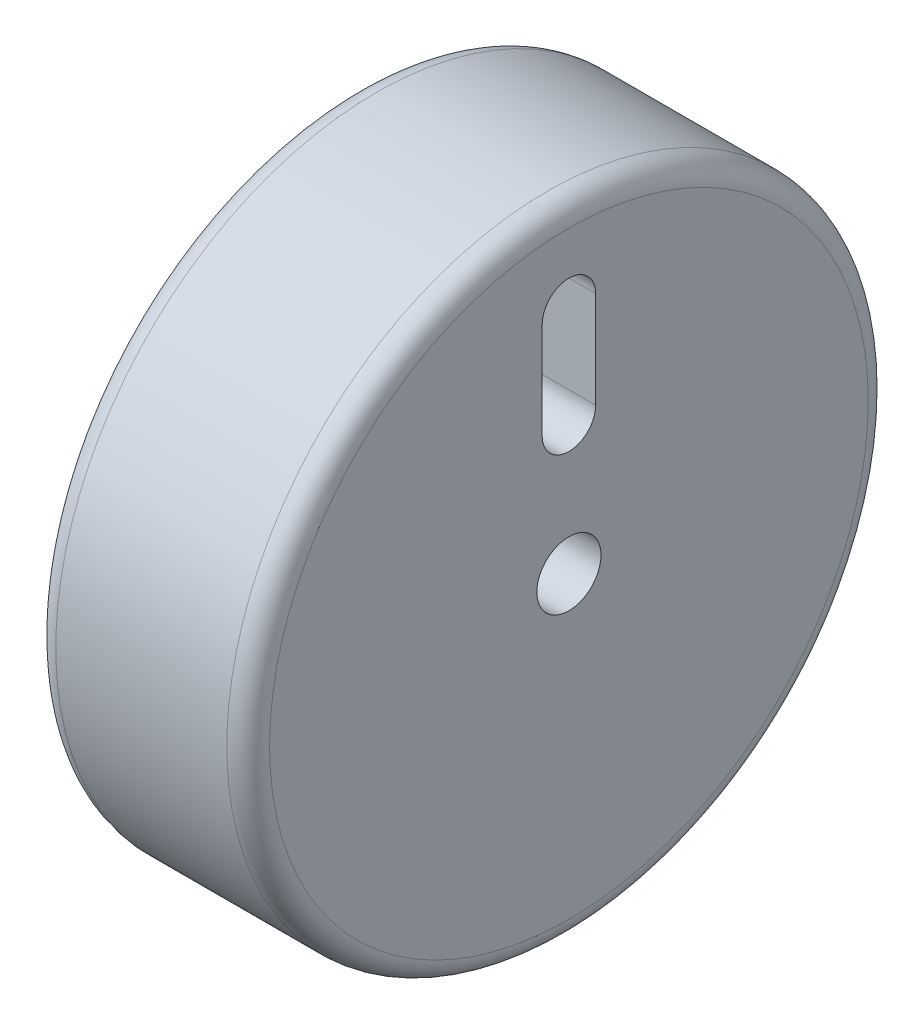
ISO-10303-21;
HEADER;
FILE_DESCRIPTION(('STEP AP214'),'2;1');
FILE_NAME('part.step','',(''),(''),'','','');
FILE_SCHEMA(('AUTOMOTIVE_DESIGN { 1 0 10303 214 1 1 1 1 }'));
ENDSEC;
DATA;
#1=APPLICATION_CONTEXT('core data for automotive mechanical design processes');
#2=APPLICATION_PROTOCOL_DEFINITION('international standard','automotive_design',2000,#1);
#3=PRODUCT_CONTEXT('',#1,'mechanical');
#4=PRODUCT('Part','Part','',(#3));
#5=PRODUCT_RELATED_PRODUCT_CATEGORY('part','',(#4));
#6=PRODUCT_DEFINITION_FORMATION('','',#4);
#7=PRODUCT_DEFINITION_CONTEXT('part definition',#1,'design');
#8=PRODUCT_DEFINITION('design','',#6,#7);
#9=PRODUCT_DEFINITION_SHAPE('','',#8);
#10=(LENGTH_UNIT() NAMED_UNIT(*) SI_UNIT(.MILLI.,.METRE.));
#11=(NAMED_UNIT(*) PLANE_ANGLE_UNIT() SI_UNIT($,.RADIAN.));
#12=(NAMED_UNIT(*) SI_UNIT($,.STERADIAN.) SOLID_ANGLE_UNIT());
#13=UNCERTAINTY_MEASURE_WITH_UNIT(LENGTH_MEASURE(1.E-05),#10,'distance_accuracy_value','');
#14=(GEOMETRIC_REPRESENTATION_CONTEXT(3) GLOBAL_UNCERTAINTY_ASSIGNED_CONTEXT((#13)) GLOBAL_UNIT_ASSIGNED_CONTEXT((#10,
#11,#12)) REPRESENTATION_CONTEXT('',''));
#15=CARTESIAN_POINT('',(0.,0.,0.));
#16=DIRECTION('',(0.,0.,1.));
#17=DIRECTION('',(1.,0.,0.));
#18=AXIS2_PLACEMENT_3D('',#15,#16,#17);
#19=CARTESIAN_POINT('',(50.,165.,0.));
#20=DIRECTION('',(1.,0.,0.));
#21=DIRECTION('',(0.,0.,-1.));
#22=AXIS2_PLACEMENT_3D('',#19,#20,#21);
#23=PLANE('',#22);
#24=CARTESIAN_POINT('',(50.,212.001808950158,0.));
#25=DIRECTION('',(1.,0.,0.));
#26=DIRECTION('',(0.,0.,-1.));
#27=AXIS2_PLACEMENT_3D('',#24,#25,#26);
#28=CIRCLE('',#27,12.5);
#29=CARTESIAN_POINT('',(50.,212.001808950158,12.5));
#30=VERTEX_POINT('',#29);
#31=CARTESIAN_POINT('',(50.,212.001808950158,-12.5));
#32=VERTEX_POINT('',#31);
#33=EDGE_CURVE('E61',#30,#32,#28,.T.);
#34=ORIENTED_EDGE('',*,*,#33,.F.);
#35=DIRECTION('',(0.,-1.,0.));
#36=VECTOR('',#35,1.);
#37=CARTESIAN_POINT('',(50.,212.001808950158,12.5));
#38=LINE('',#37,#36);
#39=CARTESIAN_POINT('',(50.,257.217101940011,12.5));
#40=VERTEX_POINT('',#39);
#41=EDGE_CURVE('E105',#40,#30,#38,.T.);
#42=ORIENTED_EDGE('',*,*,#41,.F.);
#43=CARTESIAN_POINT('',(50.,257.217101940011,0.));
#44=DIRECTION('',(1.,0.,0.));
#45=DIRECTION('',(0.,0.,-1.));
#46=AXIS2_PLACEMENT_3D('',#43,#44,#45);
#47=CIRCLE('',#46,12.5);
#48=CARTESIAN_POINT('',(50.,257.217101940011,-12.5));
#49=VERTEX_POINT('',#48);
#50=EDGE_CURVE('E108',#49,#40,#47,.T.);
#51=ORIENTED_EDGE('',*,*,#50,.F.);
#52=DIRECTION('',(0.,1.,0.));
#53=VECTOR('',#52,1.);
#54=CARTESIAN_POINT('',(50.,212.001808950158,-12.5));
#55=LINE('',#54,#53);
#56=EDGE_CURVE('E114',#32,#49,#55,.T.);
#57=ORIENTED_EDGE('',*,*,#56,.F.);
#58=EDGE_LOOP('',(#34,#42,#51,#57));
#59=FACE_BOUND('',#58,.T.);
#60=CARTESIAN_POINT('',(50.,150.,0.));
#61=DIRECTION('',(1.,0.,0.));
#62=DIRECTION('',(0.,0.,-1.));
#63=AXIS2_PLACEMENT_3D('',#60,#61,#62);
#64=CIRCLE('',#63,140.);
#65=CARTESIAN_POINT('',(50.,150.,-140.));
#66=VERTEX_POINT('',#65);
#67=EDGE_CURVE('E120',#66,#66,#64,.T.);
#68=ORIENTED_EDGE('',*,*,#67,.T.);
#69=EDGE_LOOP('',(#68));
#70=FACE_BOUND('',#69,.T.);
#71=CARTESIAN_POINT('',(50.0000000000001,150.,0.));
#72=DIRECTION('',(1.,0.,0.));
#73=DIRECTION('',(0.,0.,-1.));
#74=AXIS2_PLACEMENT_3D('',#71,#72,#73);
#75=CIRCLE('',#74,15.);
#76=CARTESIAN_POINT('',(50.0000000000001,150.,-15.));
#77=VERTEX_POINT('',#76);
#78=EDGE_CURVE('E11',#77,#77,#75,.T.);
#79=ORIENTED_EDGE('',*,*,#78,.F.);
#80=EDGE_LOOP('',(#79));
#81=FACE_BOUND('',#80,.T.);
#82=ADVANCED_FACE('F46',(#59,#70,#81),#23,.T.);
#83=CARTESIAN_POINT('',(0.,150.,0.));
#84=DIRECTION('',(1.,0.,0.));
#85=DIRECTION('',(0.,0.,-1.));
#86=AXIS2_PLACEMENT_3D('',#83,#84,#85);
#87=CYLINDRICAL_SURFACE('',#86,15.);
#88=ORIENTED_EDGE('',*,*,#78,.T.);
#89=EDGE_LOOP('',(#88));
#90=FACE_BOUND('',#89,.T.);
#91=CARTESIAN_POINT('',(-50.0000000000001,150.,0.));
#92=DIRECTION('',(1.,0.,0.));
#93=DIRECTION('',(0.,0.,-1.));
#94=AXIS2_PLACEMENT_3D('',#91,#92,#93);
#95=CIRCLE('',#94,15.);
#96=CARTESIAN_POINT('',(-50.0000000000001,150.,-15.));
#97=VERTEX_POINT('',#96);
#98=EDGE_CURVE('E54',#97,#97,#95,.T.);
#99=ORIENTED_EDGE('',*,*,#98,.F.);
#100=EDGE_LOOP('',(#99));
#101=FACE_BOUND('',#100,.T.);
#102=ADVANCED_FACE('F143',(#90,#101),#87,.F.);
#103=CARTESIAN_POINT('',(-50.,165.,0.));
#104=DIRECTION('',(-1.,0.,0.));
#105=DIRECTION('',(0.,0.,1.));
#106=AXIS2_PLACEMENT_3D('',#103,#104,#105);
#107=PLANE('',#106);
#108=CARTESIAN_POINT('',(-50.,212.001808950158,0.));
#109=DIRECTION('',(1.,0.,0.));
#110=DIRECTION('',(0.,0.,-1.));
#111=AXIS2_PLACEMENT_3D('',#108,#109,#110);
#112=CIRCLE('',#111,12.5);
#113=CARTESIAN_POINT('',(-50.,212.001808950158,12.5));
#114=VERTEX_POINT('',#113);
#115=CARTESIAN_POINT('',(-50.,212.001808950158,-12.5));
#116=VERTEX_POINT('',#115);
#117=EDGE_CURVE('E89',#114,#116,#112,.T.);
#118=ORIENTED_EDGE('',*,*,#117,.T.);
#119=DIRECTION('',(0.,1.,0.));
#120=VECTOR('',#119,1.);
#121=CARTESIAN_POINT('',(-50.,212.001808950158,-12.5));
#122=LINE('',#121,#120);
#123=CARTESIAN_POINT('',(-50.,257.217101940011,-12.5));
#124=VERTEX_POINT('',#123);
#125=EDGE_CURVE('E98',#116,#124,#122,.T.);
#126=ORIENTED_EDGE('',*,*,#125,.T.);
#127=CARTESIAN_POINT('',(-50.,257.217101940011,0.));
#128=DIRECTION('',(1.,0.,0.));
#129=DIRECTION('',(0.,0.,-1.));
#130=AXIS2_PLACEMENT_3D('',#127,#128,#129);
#131=CIRCLE('',#130,12.5);
#132=CARTESIAN_POINT('',(-50.,257.217101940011,12.5));
#133=VERTEX_POINT('',#132);
#134=EDGE_CURVE('E69',#124,#133,#131,.T.);
#135=ORIENTED_EDGE('',*,*,#134,.T.);
#136=DIRECTION('',(0.,-1.,0.));
#137=VECTOR('',#136,1.);
#138=CARTESIAN_POINT('',(-50.,212.001808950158,12.5));
#139=LINE('',#138,#137);
#140=EDGE_CURVE('E95',#133,#114,#139,.T.);
#141=ORIENTED_EDGE('',*,*,#140,.T.);
#142=EDGE_LOOP('',(#118,#126,#135,#141));
#143=FACE_BOUND('',#142,.T.);
#144=ORIENTED_EDGE('',*,*,#98,.T.);
#145=EDGE_LOOP('',(#144));
#146=FACE_BOUND('',#145,.T.);
#147=CARTESIAN_POINT('',(-50.,150.,0.));
#148=DIRECTION('',(1.,0.,0.));
#149=DIRECTION('',(0.,0.,-1.));
#150=AXIS2_PLACEMENT_3D('',#147,#148,#149);
#151=CIRCLE('',#150,140.);
#152=CARTESIAN_POINT('',(-50.,150.,-140.));
#153=VERTEX_POINT('',#152);
#154=EDGE_CURVE('E135',#153,#153,#151,.T.);
#155=ORIENTED_EDGE('',*,*,#154,.F.);
#156=EDGE_LOOP('',(#155));
#157=FACE_BOUND('',#156,.T.);
#158=ADVANCED_FACE('F102',(#143,#146,#157),#107,.T.);
#159=CARTESIAN_POINT('',(-40.,150.,0.));
#160=DIRECTION('',(1.,0.,0.));
#161=DIRECTION('',(0.,0.,-1.));
#162=AXIS2_PLACEMENT_3D('',#159,#160,#161);
#163=TOROIDAL_SURFACE('',#162,140.,10.);
#164=ORIENTED_EDGE('',*,*,#154,.T.);
#165=EDGE_LOOP('',(#164));
#166=FACE_BOUND('',#165,.T.);
#167=CARTESIAN_POINT('',(-39.9999999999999,150.,0.));
#168=DIRECTION('',(1.,0.,0.));
#169=DIRECTION('',(0.,0.,-1.));
#170=AXIS2_PLACEMENT_3D('',#167,#168,#169);
#171=CIRCLE('',#170,150.);
#172=CARTESIAN_POINT('',(-39.9999999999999,150.,-150.));
#173=VERTEX_POINT('',#172);
#174=EDGE_CURVE('E131',#173,#173,#171,.T.);
#175=ORIENTED_EDGE('',*,*,#174,.F.);
#176=EDGE_LOOP('',(#175));
#177=FACE_BOUND('',#176,.T.);
#178=ADVANCED_FACE('F150',(#166,#177),#163,.T.);
#179=CARTESIAN_POINT('',(0.,150.,0.));
#180=DIRECTION('',(1.,0.,0.));
#181=DIRECTION('',(0.,0.,-1.));
#182=AXIS2_PLACEMENT_3D('',#179,#180,#181);
#183=CYLINDRICAL_SURFACE('',#182,150.);
#184=ORIENTED_EDGE('',*,*,#174,.T.);
#185=EDGE_LOOP('',(#184));
#186=FACE_BOUND('',#185,.T.);
#187=CARTESIAN_POINT('',(39.9999999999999,150.,0.));
#188=DIRECTION('',(1.,0.,0.));
#189=DIRECTION('',(0.,0.,-1.));
#190=AXIS2_PLACEMENT_3D('',#187,#188,#189);
#191=CIRCLE('',#190,150.);
#192=CARTESIAN_POINT('',(39.9999999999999,150.,-150.));
#193=VERTEX_POINT('',#192);
#194=EDGE_CURVE('E127',#193,#193,#191,.T.);
#195=ORIENTED_EDGE('',*,*,#194,.F.);
#196=EDGE_LOOP('',(#195));
#197=FACE_BOUND('',#196,.T.);
#198=ADVANCED_FACE('F156',(#186,#197),#183,.T.);
#199=CARTESIAN_POINT('',(40.,150.,0.));
#200=DIRECTION('',(1.,0.,0.));
#201=DIRECTION('',(0.,0.,-1.));
#202=AXIS2_PLACEMENT_3D('',#199,#200,#201);
#203=TOROIDAL_SURFACE('',#202,140.,10.);
#204=ORIENTED_EDGE('',*,*,#194,.T.);
#205=EDGE_LOOP('',(#204));
#206=FACE_BOUND('',#205,.T.);
#207=ORIENTED_EDGE('',*,*,#67,.F.);
#208=EDGE_LOOP('',(#207));
#209=FACE_BOUND('',#208,.T.);
#210=ADVANCED_FACE('F160',(#206,#209),#203,.T.);
#211=CARTESIAN_POINT('',(-50.,212.001808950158,0.));
#212=DIRECTION('',(1.,0.,0.));
#213=DIRECTION('',(0.,0.,-1.));
#214=AXIS2_PLACEMENT_3D('',#211,#212,#213);
#215=CYLINDRICAL_SURFACE('',#214,12.5);
#216=ORIENTED_EDGE('',*,*,#33,.T.);
#217=DIRECTION('',(1.,0.,0.));
#218=VECTOR('',#217,1.);
#219=CARTESIAN_POINT('',(-50.,212.001808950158,-12.5));
#220=LINE('',#219,#218);
#221=EDGE_CURVE('E85',#116,#32,#220,.T.);
#222=ORIENTED_EDGE('',*,*,#221,.F.);
#223=ORIENTED_EDGE('',*,*,#117,.F.);
#224=DIRECTION('',(1.,0.,0.));
#225=VECTOR('',#224,1.);
#226=CARTESIAN_POINT('',(-50.,212.001808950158,12.5));
#227=LINE('',#226,#225);
#228=EDGE_CURVE('E118',#114,#30,#227,.T.);
#229=ORIENTED_EDGE('',*,*,#228,.T.);
#230=EDGE_LOOP('',(#216,#222,#223,#229));
#231=FACE_BOUND('',#230,.T.);
#232=ADVANCED_FACE('F87',(#231),#215,.F.);
#233=CARTESIAN_POINT('',(-50.,212.001808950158,12.5));
#234=DIRECTION('',(0.,0.,1.));
#235=DIRECTION('',(1.,0.,0.));
#236=AXIS2_PLACEMENT_3D('',#233,#234,#235);
#237=PLANE('',#236);
#238=ORIENTED_EDGE('',*,*,#41,.T.);
#239=ORIENTED_EDGE('',*,*,#228,.F.);
#240=ORIENTED_EDGE('',*,*,#140,.F.);
#241=DIRECTION('',(1.,0.,0.));
#242=VECTOR('',#241,1.);
#243=CARTESIAN_POINT('',(-50.,257.217101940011,12.5));
#244=LINE('',#243,#242);
#245=EDGE_CURVE('E121',#133,#40,#244,.T.);
#246=ORIENTED_EDGE('',*,*,#245,.T.);
#247=EDGE_LOOP('',(#238,#239,#240,#246));
#248=FACE_BOUND('',#247,.T.);
#249=ADVANCED_FACE('F167',(#248),#237,.F.);
#250=CARTESIAN_POINT('',(-50.,257.217101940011,0.));
#251=DIRECTION('',(1.,0.,0.));
#252=DIRECTION('',(0.,0.,-1.));
#253=AXIS2_PLACEMENT_3D('',#250,#251,#252);
#254=CYLINDRICAL_SURFACE('',#253,12.5);
#255=ORIENTED_EDGE('',*,*,#50,.T.);
#256=ORIENTED_EDGE('',*,*,#245,.F.);
#257=ORIENTED_EDGE('',*,*,#134,.F.);
#258=DIRECTION('',(1.,0.,0.));
#259=VECTOR('',#258,1.);
#260=CARTESIAN_POINT('',(-50.,257.217101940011,-12.5));
#261=LINE('',#260,#259);
#262=EDGE_CURVE('E94',#124,#49,#261,.T.);
#263=ORIENTED_EDGE('',*,*,#262,.T.);
#264=EDGE_LOOP('',(#255,#256,#257,#263));
#265=FACE_BOUND('',#264,.T.);
#266=ADVANCED_FACE('F170',(#265),#254,.F.);
#267=CARTESIAN_POINT('',(-50.,212.001808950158,-12.5));
#268=DIRECTION('',(0.,0.,-1.));
#269=DIRECTION('',(-1.,0.,0.));
#270=AXIS2_PLACEMENT_3D('',#267,#268,#269);
#271=PLANE('',#270);
#272=ORIENTED_EDGE('',*,*,#56,.T.);
#273=ORIENTED_EDGE('',*,*,#262,.F.);
#274=ORIENTED_EDGE('',*,*,#125,.F.);
#275=ORIENTED_EDGE('',*,*,#221,.T.);
#276=EDGE_LOOP('',(#272,#273,#274,#275));
#277=FACE_BOUND('',#276,.T.);
#278=ADVANCED_FACE('F99',(#277),#271,.F.);
#279=CLOSED_SHELL('',(#82,#102,#158,#178,#198,#210,#232,#249,#266,#278));
#280=MANIFOLD_SOLID_BREP('B2',#279);
#281=ADVANCED_BREP_SHAPE_REPRESENTATION('',(#18,#280),#14);
#282=SHAPE_DEFINITION_REPRESENTATION(#9,#281);
ENDSEC;
END-ISO-10303-21;
